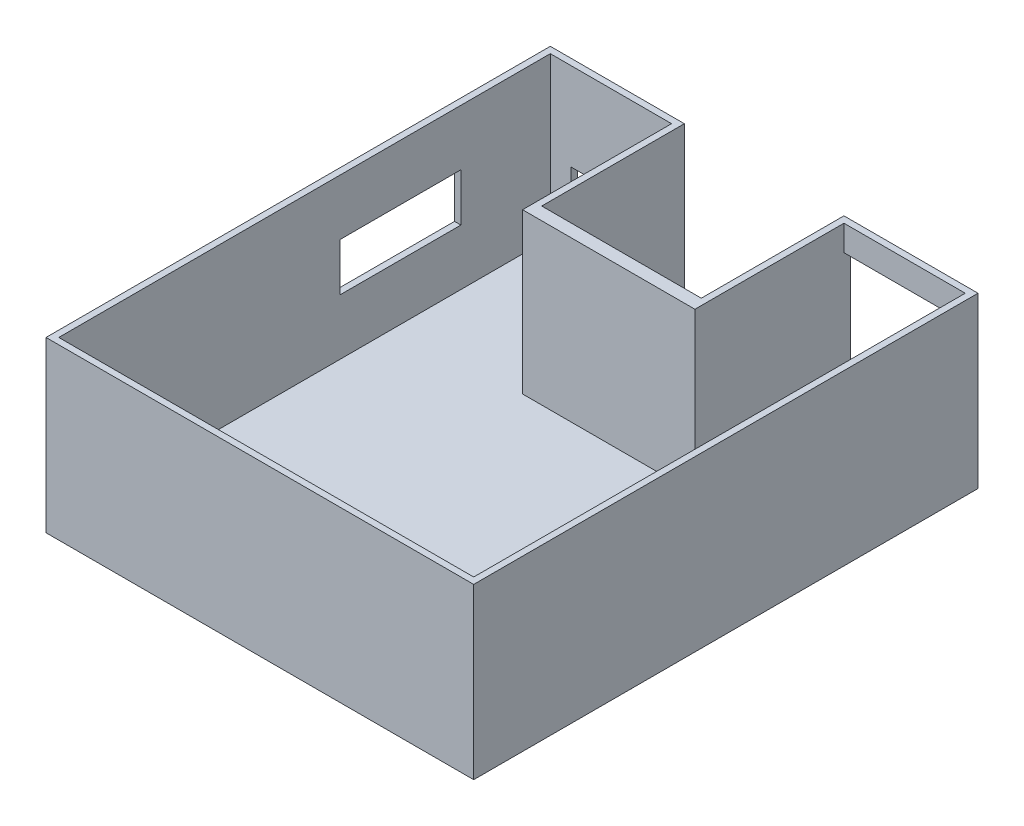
ISO-10303-21;
HEADER;
FILE_DESCRIPTION(('STEP AP214'),'2;1');
FILE_NAME('part.step','',(''),(''),'','','');
FILE_SCHEMA(('AUTOMOTIVE_DESIGN { 1 0 10303 214 1 1 1 1 }'));
ENDSEC;
DATA;
#1=APPLICATION_CONTEXT('core data for automotive mechanical design processes');
#2=APPLICATION_PROTOCOL_DEFINITION('international standard','automotive_design',2000,#1);
#3=PRODUCT_CONTEXT('',#1,'mechanical');
#4=PRODUCT('Part','Part','',(#3));
#5=PRODUCT_RELATED_PRODUCT_CATEGORY('part','',(#4));
#6=PRODUCT_DEFINITION_FORMATION('','',#4);
#7=PRODUCT_DEFINITION_CONTEXT('part definition',#1,'design');
#8=PRODUCT_DEFINITION('design','',#6,#7);
#9=PRODUCT_DEFINITION_SHAPE('','',#8);
#10=(LENGTH_UNIT() NAMED_UNIT(*) SI_UNIT(.MILLI.,.METRE.));
#11=(NAMED_UNIT(*) PLANE_ANGLE_UNIT() SI_UNIT($,.RADIAN.));
#12=(NAMED_UNIT(*) SI_UNIT($,.STERADIAN.) SOLID_ANGLE_UNIT());
#13=UNCERTAINTY_MEASURE_WITH_UNIT(LENGTH_MEASURE(1.E-05),#10,'distance_accuracy_value','');
#14=(GEOMETRIC_REPRESENTATION_CONTEXT(3) GLOBAL_UNCERTAINTY_ASSIGNED_CONTEXT((#13)) GLOBAL_UNIT_ASSIGNED_CONTEXT((#10,
#11,#12)) REPRESENTATION_CONTEXT('',''));
#15=CARTESIAN_POINT('',(0.,0.,0.));
#16=DIRECTION('',(0.,0.,1.));
#17=DIRECTION('',(1.,0.,0.));
#18=AXIS2_PLACEMENT_3D('',#15,#16,#17);
#19=CARTESIAN_POINT('',(-27.,0.,-99.));
#20=DIRECTION('',(0.,0.,1.));
#21=DIRECTION('',(1.,0.,0.));
#22=AXIS2_PLACEMENT_3D('',#19,#20,#21);
#23=PLANE('',#22);
#24=DIRECTION('',(0.,1.,0.));
#25=VECTOR('',#24,1.);
#26=CARTESIAN_POINT('',(-33.5000000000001,0.,-99.));
#27=LINE('',#26,#25);
#28=CARTESIAN_POINT('',(-33.5000000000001,15.5,-99.));
#29=VERTEX_POINT('',#28);
#30=CARTESIAN_POINT('',(-33.5000000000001,25.5,-99.));
#31=VERTEX_POINT('',#30);
#32=EDGE_CURVE('E302',#29,#31,#27,.T.);
#33=ORIENTED_EDGE('',*,*,#32,.F.);
#34=DIRECTION('',(1.,0.,0.));
#35=VECTOR('',#34,1.);
#36=CARTESIAN_POINT('',(-27.,15.5,-99.));
#37=LINE('',#36,#35);
#38=CARTESIAN_POINT('',(-58.5000000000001,15.5,-99.));
#39=VERTEX_POINT('',#38);
#40=EDGE_CURVE('E295',#39,#29,#37,.T.);
#41=ORIENTED_EDGE('',*,*,#40,.F.);
#42=DIRECTION('',(0.,-1.,0.));
#43=VECTOR('',#42,1.);
#44=CARTESIAN_POINT('',(-58.5000000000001,0.,-99.));
#45=LINE('',#44,#43);
#46=CARTESIAN_POINT('',(-58.5000000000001,25.5,-99.));
#47=VERTEX_POINT('',#46);
#48=EDGE_CURVE('E297',#47,#39,#45,.T.);
#49=ORIENTED_EDGE('',*,*,#48,.F.);
#50=DIRECTION('',(-1.,0.,0.));
#51=VECTOR('',#50,1.);
#52=CARTESIAN_POINT('',(-27.,25.5,-99.));
#53=LINE('',#52,#51);
#54=EDGE_CURVE('E300',#31,#47,#53,.T.);
#55=ORIENTED_EDGE('',*,*,#54,.F.);
#56=EDGE_LOOP('',(#33,#41,#49,#55));
#57=FACE_BOUND('',#56,.T.);
#58=DIRECTION('',(1.,0.,0.));
#59=VECTOR('',#58,1.);
#60=CARTESIAN_POINT('',(-27.,53.,-99.));
#61=LINE('',#60,#59);
#62=CARTESIAN_POINT('',(-65.,53.,-99.));
#63=VERTEX_POINT('',#62);
#64=CARTESIAN_POINT('',(-27.,53.,-99.));
#65=VERTEX_POINT('',#64);
#66=EDGE_CURVE('E372',#63,#65,#61,.T.);
#67=ORIENTED_EDGE('',*,*,#66,.F.);
#68=DIRECTION('',(0.,-1.,0.));
#69=VECTOR('',#68,1.);
#70=CARTESIAN_POINT('',(-65.,0.,-99.));
#71=LINE('',#70,#69);
#72=CARTESIAN_POINT('',(-65.,3.,-99.));
#73=VERTEX_POINT('',#72);
#74=EDGE_CURVE('E359',#63,#73,#71,.T.);
#75=ORIENTED_EDGE('',*,*,#74,.T.);
#76=DIRECTION('',(1.,0.,0.));
#77=VECTOR('',#76,1.);
#78=CARTESIAN_POINT('',(0.,3.,-99.));
#79=LINE('',#78,#77);
#80=CARTESIAN_POINT('',(-27.,3.,-99.));
#81=VERTEX_POINT('',#80);
#82=EDGE_CURVE('E389',#73,#81,#79,.T.);
#83=ORIENTED_EDGE('',*,*,#82,.T.);
#84=DIRECTION('',(0.,1.,0.));
#85=VECTOR('',#84,1.);
#86=CARTESIAN_POINT('',(-27.,0.,-99.));
#87=LINE('',#86,#85);
#88=EDGE_CURVE('E385',#81,#65,#87,.T.);
#89=ORIENTED_EDGE('',*,*,#88,.T.);
#90=EDGE_LOOP('',(#67,#75,#83,#89));
#91=FACE_BOUND('',#90,.T.);
#92=ADVANCED_FACE('F41',(#57,#91),#23,.T.);
#93=CARTESIAN_POINT('',(65.,3.,-101.));
#94=DIRECTION('',(0.,0.,1.));
#95=DIRECTION('',(1.,0.,0.));
#96=AXIS2_PLACEMENT_3D('',#93,#94,#95);
#97=PLANE('',#96);
#98=DIRECTION('',(-1.,0.,0.));
#99=VECTOR('',#98,1.);
#100=CARTESIAN_POINT('',(63.9999999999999,3.,-101.));
#101=LINE('',#100,#99);
#102=CARTESIAN_POINT('',(63.9999999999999,3.,-101.));
#103=VERTEX_POINT('',#102);
#104=CARTESIAN_POINT('',(26.9999999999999,3.,-101.));
#105=VERTEX_POINT('',#104);
#106=EDGE_CURVE('E258',#103,#105,#101,.T.);
#107=ORIENTED_EDGE('',*,*,#106,.F.);
#108=DIRECTION('',(0.,-1.,0.));
#109=VECTOR('',#108,1.);
#110=CARTESIAN_POINT('',(63.9999999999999,45.,-101.));
#111=LINE('',#110,#109);
#112=CARTESIAN_POINT('',(63.9999999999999,45.,-101.));
#113=VERTEX_POINT('',#112);
#114=EDGE_CURVE('E256',#113,#103,#111,.T.);
#115=ORIENTED_EDGE('',*,*,#114,.F.);
#116=DIRECTION('',(1.,0.,0.));
#117=VECTOR('',#116,1.);
#118=CARTESIAN_POINT('',(63.9999999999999,45.,-101.));
#119=LINE('',#118,#117);
#120=CARTESIAN_POINT('',(26.9999999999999,45.,-101.));
#121=VERTEX_POINT('',#120);
#122=EDGE_CURVE('E265',#121,#113,#119,.T.);
#123=ORIENTED_EDGE('',*,*,#122,.F.);
#124=DIRECTION('',(0.,1.,0.));
#125=VECTOR('',#124,1.);
#126=CARTESIAN_POINT('',(26.9999999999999,45.,-101.));
#127=LINE('',#126,#125);
#128=EDGE_CURVE('E262',#105,#121,#127,.T.);
#129=ORIENTED_EDGE('',*,*,#128,.F.);
#130=EDGE_LOOP('',(#107,#115,#123,#129));
#131=FACE_BOUND('',#130,.T.);
#132=DIRECTION('',(-1.,0.,0.));
#133=VECTOR('',#132,1.);
#134=CARTESIAN_POINT('',(65.,0.,-101.));
#135=LINE('',#134,#133);
#136=CARTESIAN_POINT('',(67.,0.,-101.));
#137=VERTEX_POINT('',#136);
#138=CARTESIAN_POINT('',(25.,0.,-101.));
#139=VERTEX_POINT('',#138);
#140=EDGE_CURVE('E399',#137,#139,#135,.T.);
#141=ORIENTED_EDGE('',*,*,#140,.T.);
#142=DIRECTION('',(0.,-1.,0.));
#143=VECTOR('',#142,1.);
#144=CARTESIAN_POINT('',(25.,3.,-101.));
#145=LINE('',#144,#143);
#146=CARTESIAN_POINT('',(25.,53.,-101.));
#147=VERTEX_POINT('',#146);
#148=EDGE_CURVE('E421',#147,#139,#145,.T.);
#149=ORIENTED_EDGE('',*,*,#148,.F.);
#150=DIRECTION('',(-1.,0.,0.));
#151=VECTOR('',#150,1.);
#152=CARTESIAN_POINT('',(0.,53.,-101.));
#153=LINE('',#152,#151);
#154=CARTESIAN_POINT('',(67.,53.,-101.));
#155=VERTEX_POINT('',#154);
#156=EDGE_CURVE('E336',#155,#147,#153,.T.);
#157=ORIENTED_EDGE('',*,*,#156,.F.);
#158=DIRECTION('',(0.,1.,0.));
#159=VECTOR('',#158,1.);
#160=CARTESIAN_POINT('',(67.,0.,-101.));
#161=LINE('',#160,#159);
#162=EDGE_CURVE('E356',#137,#155,#161,.T.);
#163=ORIENTED_EDGE('',*,*,#162,.F.);
#164=EDGE_LOOP('',(#141,#149,#157,#163));
#165=FACE_BOUND('',#164,.T.);
#166=ADVANCED_FACE('F43',(#131,#165),#97,.F.);
#167=CARTESIAN_POINT('',(25.,3.,-52.311907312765));
#168=DIRECTION('',(1.,0.,0.));
#169=DIRECTION('',(0.,0.,-1.));
#170=AXIS2_PLACEMENT_3D('',#167,#168,#169);
#171=PLANE('',#170);
#172=DIRECTION('',(0.,0.,1.));
#173=VECTOR('',#172,1.);
#174=CARTESIAN_POINT('',(25.,0.,-52.311907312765));
#175=LINE('',#174,#173);
#176=CARTESIAN_POINT('',(25.,0.,-56.311907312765));
#177=VERTEX_POINT('',#176);
#178=EDGE_CURVE('E414',#139,#177,#175,.T.);
#179=ORIENTED_EDGE('',*,*,#178,.T.);
#180=DIRECTION('',(0.,1.,0.));
#181=VECTOR('',#180,1.);
#182=CARTESIAN_POINT('',(25.,0.,-56.311907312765));
#183=LINE('',#182,#181);
#184=CARTESIAN_POINT('',(25.,53.,-56.311907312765));
#185=VERTEX_POINT('',#184);
#186=EDGE_CURVE('E310',#177,#185,#183,.T.);
#187=ORIENTED_EDGE('',*,*,#186,.T.);
#188=DIRECTION('',(0.,0.,1.));
#189=VECTOR('',#188,1.);
#190=CARTESIAN_POINT('',(25.,53.,-52.311907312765));
#191=LINE('',#190,#189);
#192=EDGE_CURVE('E319',#147,#185,#191,.T.);
#193=ORIENTED_EDGE('',*,*,#192,.F.);
#194=ORIENTED_EDGE('',*,*,#148,.T.);
#195=EDGE_LOOP('',(#179,#187,#193,#194));
#196=FACE_BOUND('',#195,.T.);
#197=ADVANCED_FACE('F465',(#196),#171,.F.);
#198=CARTESIAN_POINT('',(-25.,3.,-52.311907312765));
#199=DIRECTION('',(-1.,0.,0.));
#200=DIRECTION('',(0.,0.,1.));
#201=AXIS2_PLACEMENT_3D('',#198,#199,#200);
#202=PLANE('',#201);
#203=DIRECTION('',(0.,0.,-1.));
#204=VECTOR('',#203,1.);
#205=CARTESIAN_POINT('',(-25.,53.,-101.));
#206=LINE('',#205,#204);
#207=CARTESIAN_POINT('',(-25.,53.,-56.311907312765));
#208=VERTEX_POINT('',#207);
#209=CARTESIAN_POINT('',(-25.,53.,-101.));
#210=VERTEX_POINT('',#209);
#211=EDGE_CURVE('E379',#208,#210,#206,.T.);
#212=ORIENTED_EDGE('',*,*,#211,.F.);
#213=DIRECTION('',(0.,1.,0.));
#214=VECTOR('',#213,1.);
#215=CARTESIAN_POINT('',(-25.,0.,-56.311907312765));
#216=LINE('',#215,#214);
#217=CARTESIAN_POINT('',(-25.,0.,-56.311907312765));
#218=VERTEX_POINT('',#217);
#219=EDGE_CURVE('E311',#218,#208,#216,.T.);
#220=ORIENTED_EDGE('',*,*,#219,.F.);
#221=DIRECTION('',(0.,0.,-1.));
#222=VECTOR('',#221,1.);
#223=CARTESIAN_POINT('',(-25.,0.,-52.311907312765));
#224=LINE('',#223,#222);
#225=CARTESIAN_POINT('',(-25.,0.,-101.));
#226=VERTEX_POINT('',#225);
#227=EDGE_CURVE('E416',#218,#226,#224,.T.);
#228=ORIENTED_EDGE('',*,*,#227,.T.);
#229=DIRECTION('',(0.,-1.,0.));
#230=VECTOR('',#229,1.);
#231=CARTESIAN_POINT('',(-25.,3.,-101.));
#232=LINE('',#231,#230);
#233=EDGE_CURVE('E412',#210,#226,#232,.T.);
#234=ORIENTED_EDGE('',*,*,#233,.F.);
#235=EDGE_LOOP('',(#212,#220,#228,#234));
#236=FACE_BOUND('',#235,.T.);
#237=ADVANCED_FACE('F500',(#236),#202,.F.);
#238=CARTESIAN_POINT('',(-65.,3.,-101.));
#239=DIRECTION('',(0.,0.,1.));
#240=DIRECTION('',(1.,0.,0.));
#241=AXIS2_PLACEMENT_3D('',#238,#239,#240);
#242=PLANE('',#241);
#243=DIRECTION('',(-1.,0.,0.));
#244=VECTOR('',#243,1.);
#245=CARTESIAN_POINT('',(-33.5000000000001,15.5,-101.));
#246=LINE('',#245,#244);
#247=CARTESIAN_POINT('',(-33.5000000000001,15.5,-101.));
#248=VERTEX_POINT('',#247);
#249=CARTESIAN_POINT('',(-58.5000000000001,15.5,-101.));
#250=VERTEX_POINT('',#249);
#251=EDGE_CURVE('E290',#248,#250,#246,.T.);
#252=ORIENTED_EDGE('',*,*,#251,.F.);
#253=DIRECTION('',(0.,-1.,0.));
#254=VECTOR('',#253,1.);
#255=CARTESIAN_POINT('',(-33.5000000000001,25.5,-101.));
#256=LINE('',#255,#254);
#257=CARTESIAN_POINT('',(-33.5000000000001,25.5,-101.));
#258=VERTEX_POINT('',#257);
#259=EDGE_CURVE('E259',#258,#248,#256,.T.);
#260=ORIENTED_EDGE('',*,*,#259,.F.);
#261=DIRECTION('',(1.,0.,0.));
#262=VECTOR('',#261,1.);
#263=CARTESIAN_POINT('',(-33.5000000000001,25.5,-101.));
#264=LINE('',#263,#262);
#265=CARTESIAN_POINT('',(-58.5000000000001,25.5,-101.));
#266=VERTEX_POINT('',#265);
#267=EDGE_CURVE('E279',#266,#258,#264,.T.);
#268=ORIENTED_EDGE('',*,*,#267,.F.);
#269=DIRECTION('',(0.,1.,0.));
#270=VECTOR('',#269,1.);
#271=CARTESIAN_POINT('',(-58.5000000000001,25.5,-101.));
#272=LINE('',#271,#270);
#273=EDGE_CURVE('E287',#250,#266,#272,.T.);
#274=ORIENTED_EDGE('',*,*,#273,.F.);
#275=EDGE_LOOP('',(#252,#260,#268,#274));
#276=FACE_BOUND('',#275,.T.);
#277=DIRECTION('',(0.,1.,0.));
#278=VECTOR('',#277,1.);
#279=CARTESIAN_POINT('',(-67.,0.,-101.));
#280=LINE('',#279,#278);
#281=CARTESIAN_POINT('',(-67.,0.,-101.));
#282=VERTEX_POINT('',#281);
#283=CARTESIAN_POINT('',(-67.,53.,-101.));
#284=VERTEX_POINT('',#283);
#285=EDGE_CURVE('E386',#282,#284,#280,.T.);
#286=ORIENTED_EDGE('',*,*,#285,.T.);
#287=DIRECTION('',(-1.,0.,0.));
#288=VECTOR('',#287,1.);
#289=CARTESIAN_POINT('',(-67.,53.,-101.));
#290=LINE('',#289,#288);
#291=EDGE_CURVE('E381',#210,#284,#290,.T.);
#292=ORIENTED_EDGE('',*,*,#291,.F.);
#293=ORIENTED_EDGE('',*,*,#233,.T.);
#294=DIRECTION('',(-1.,0.,0.));
#295=VECTOR('',#294,1.);
#296=CARTESIAN_POINT('',(-65.,0.,-101.));
#297=LINE('',#296,#295);
#298=EDGE_CURVE('E404',#226,#282,#297,.T.);
#299=ORIENTED_EDGE('',*,*,#298,.T.);
#300=EDGE_LOOP('',(#286,#292,#293,#299));
#301=FACE_BOUND('',#300,.T.);
#302=ADVANCED_FACE('F496',(#276,#301),#242,.F.);
#303=CARTESIAN_POINT('',(0.,3.,0.));
#304=DIRECTION('',(0.,1.,0.));
#305=DIRECTION('',(0.,0.,1.));
#306=AXIS2_PLACEMENT_3D('',#303,#304,#305);
#307=PLANE('',#306);
#308=DIRECTION('',(1.,0.,0.));
#309=VECTOR('',#308,1.);
#310=CARTESIAN_POINT('',(0.,3.,-99.));
#311=LINE('',#310,#309);
#312=CARTESIAN_POINT('',(63.9999999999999,3.,-99.));
#313=VERTEX_POINT('',#312);
#314=CARTESIAN_POINT('',(65.,3.,-99.));
#315=VERTEX_POINT('',#314);
#316=EDGE_CURVE('E329',#313,#315,#311,.T.);
#317=ORIENTED_EDGE('',*,*,#316,.F.);
#318=DIRECTION('',(0.,0.,-1.));
#319=VECTOR('',#318,1.);
#320=CARTESIAN_POINT('',(63.9999999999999,3.,-63.));
#321=LINE('',#320,#319);
#322=EDGE_CURVE('E268',#313,#103,#321,.T.);
#323=ORIENTED_EDGE('',*,*,#322,.T.);
#324=ORIENTED_EDGE('',*,*,#106,.T.);
#325=DIRECTION('',(0.,0.,-1.));
#326=VECTOR('',#325,1.);
#327=CARTESIAN_POINT('',(27.,3.,0.));
#328=LINE('',#327,#326);
#329=CARTESIAN_POINT('',(27.,3.,-52.311907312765));
#330=VERTEX_POINT('',#329);
#331=EDGE_CURVE('E331',#330,#105,#328,.T.);
#332=ORIENTED_EDGE('',*,*,#331,.F.);
#333=DIRECTION('',(-1.,0.,0.));
#334=VECTOR('',#333,1.);
#335=CARTESIAN_POINT('',(-25.,3.,-52.311907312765));
#336=LINE('',#335,#334);
#337=CARTESIAN_POINT('',(-27.,3.,-52.311907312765));
#338=VERTEX_POINT('',#337);
#339=EDGE_CURVE('E403',#330,#338,#336,.T.);
#340=ORIENTED_EDGE('',*,*,#339,.T.);
#341=DIRECTION('',(0.,0.,1.));
#342=VECTOR('',#341,1.);
#343=CARTESIAN_POINT('',(-27.,3.,0.));
#344=LINE('',#343,#342);
#345=EDGE_CURVE('E396',#81,#338,#344,.T.);
#346=ORIENTED_EDGE('',*,*,#345,.F.);
#347=ORIENTED_EDGE('',*,*,#82,.F.);
#348=DIRECTION('',(0.,0.,1.));
#349=VECTOR('',#348,1.);
#350=CARTESIAN_POINT('',(-65.,3.,-55.));
#351=LINE('',#350,#349);
#352=CARTESIAN_POINT('',(-65.,3.,55.));
#353=VERTEX_POINT('',#352);
#354=EDGE_CURVE('E406',#73,#353,#351,.T.);
#355=ORIENTED_EDGE('',*,*,#354,.T.);
#356=DIRECTION('',(1.,0.,0.));
#357=VECTOR('',#356,1.);
#358=CARTESIAN_POINT('',(-65.,3.,55.));
#359=LINE('',#358,#357);
#360=CARTESIAN_POINT('',(65.,3.,55.));
#361=VERTEX_POINT('',#360);
#362=EDGE_CURVE('E409',#353,#361,#359,.T.);
#363=ORIENTED_EDGE('',*,*,#362,.T.);
#364=DIRECTION('',(0.,0.,-1.));
#365=VECTOR('',#364,1.);
#366=CARTESIAN_POINT('',(65.,3.,-55.));
#367=LINE('',#366,#365);
#368=EDGE_CURVE('E400',#361,#315,#367,.T.);
#369=ORIENTED_EDGE('',*,*,#368,.T.);
#370=EDGE_LOOP('',(#317,#323,#324,#332,#340,#346,#347,#355,#363,#369));
#371=FACE_BOUND('',#370,.T.);
#372=ADVANCED_FACE('F433',(#371),#307,.T.);
#373=CARTESIAN_POINT('',(0.,0.,0.));
#374=DIRECTION('',(0.,1.,0.));
#375=DIRECTION('',(0.,0.,1.));
#376=AXIS2_PLACEMENT_3D('',#373,#374,#375);
#377=PLANE('',#376);
#378=ORIENTED_EDGE('',*,*,#227,.F.);
#379=DIRECTION('',(-1.,0.,0.));
#380=VECTOR('',#379,1.);
#381=CARTESIAN_POINT('',(-25.,0.,-56.311907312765));
#382=LINE('',#381,#380);
#383=EDGE_CURVE('E307',#177,#218,#382,.T.);
#384=ORIENTED_EDGE('',*,*,#383,.F.);
#385=ORIENTED_EDGE('',*,*,#178,.F.);
#386=ORIENTED_EDGE('',*,*,#140,.F.);
#387=DIRECTION('',(0.,0.,-1.));
#388=VECTOR('',#387,1.);
#389=CARTESIAN_POINT('',(67.,0.,0.));
#390=LINE('',#389,#388);
#391=CARTESIAN_POINT('',(67.,0.,57.));
#392=VERTEX_POINT('',#391);
#393=EDGE_CURVE('E350',#392,#137,#390,.T.);
#394=ORIENTED_EDGE('',*,*,#393,.F.);
#395=DIRECTION('',(1.,0.,0.));
#396=VECTOR('',#395,1.);
#397=CARTESIAN_POINT('',(0.,0.,57.));
#398=LINE('',#397,#396);
#399=CARTESIAN_POINT('',(-67.,0.,57.));
#400=VERTEX_POINT('',#399);
#401=EDGE_CURVE('E353',#400,#392,#398,.T.);
#402=ORIENTED_EDGE('',*,*,#401,.F.);
#403=DIRECTION('',(0.,0.,1.));
#404=VECTOR('',#403,1.);
#405=CARTESIAN_POINT('',(-67.,0.,-99.));
#406=LINE('',#405,#404);
#407=EDGE_CURVE('E383',#282,#400,#406,.T.);
#408=ORIENTED_EDGE('',*,*,#407,.F.);
#409=ORIENTED_EDGE('',*,*,#298,.F.);
#410=EDGE_LOOP('',(#378,#384,#385,#386,#394,#402,#408,#409));
#411=FACE_BOUND('',#410,.T.);
#412=ADVANCED_FACE('F476',(#411),#377,.F.);
#413=CARTESIAN_POINT('',(-67.,0.,-99.));
#414=DIRECTION('',(-1.,0.,0.));
#415=DIRECTION('',(0.,0.,1.));
#416=AXIS2_PLACEMENT_3D('',#413,#414,#415);
#417=PLANE('',#416);
#418=DIRECTION('',(0.,-1.,0.));
#419=VECTOR('',#418,1.);
#420=CARTESIAN_POINT('',(-67.,35.5,-71.));
#421=LINE('',#420,#419);
#422=CARTESIAN_POINT('',(-67.,35.5,-71.));
#423=VERTEX_POINT('',#422);
#424=CARTESIAN_POINT('',(-67.,20.5,-71.));
#425=VERTEX_POINT('',#424);
#426=EDGE_CURVE('E56',#423,#425,#421,.T.);
#427=ORIENTED_EDGE('',*,*,#426,.F.);
#428=DIRECTION('',(0.,0.,1.));
#429=VECTOR('',#428,1.);
#430=CARTESIAN_POINT('',(-67.,35.5,-71.));
#431=LINE('',#430,#429);
#432=CARTESIAN_POINT('',(-67.,35.5,-33.104592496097));
#433=VERTEX_POINT('',#432);
#434=EDGE_CURVE('E227',#423,#433,#431,.T.);
#435=ORIENTED_EDGE('',*,*,#434,.T.);
#436=DIRECTION('',(0.,-1.,0.));
#437=VECTOR('',#436,1.);
#438=CARTESIAN_POINT('',(-67.,35.5,-33.104592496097));
#439=LINE('',#438,#437);
#440=CARTESIAN_POINT('',(-67.,20.5,-33.104592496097));
#441=VERTEX_POINT('',#440);
#442=EDGE_CURVE('E247',#433,#441,#439,.T.);
#443=ORIENTED_EDGE('',*,*,#442,.T.);
#444=DIRECTION('',(0.,0.,1.));
#445=VECTOR('',#444,1.);
#446=CARTESIAN_POINT('',(-67.,20.5,-71.));
#447=LINE('',#446,#445);
#448=EDGE_CURVE('E241',#425,#441,#447,.T.);
#449=ORIENTED_EDGE('',*,*,#448,.F.);
#450=EDGE_LOOP('',(#427,#435,#443,#449));
#451=FACE_BOUND('',#450,.T.);
#452=ORIENTED_EDGE('',*,*,#407,.T.);
#453=DIRECTION('',(0.,1.,0.));
#454=VECTOR('',#453,1.);
#455=CARTESIAN_POINT('',(-67.,0.,57.));
#456=LINE('',#455,#454);
#457=CARTESIAN_POINT('',(-67.,53.,57.));
#458=VERTEX_POINT('',#457);
#459=EDGE_CURVE('E360',#400,#458,#456,.T.);
#460=ORIENTED_EDGE('',*,*,#459,.T.);
#461=DIRECTION('',(0.,0.,1.));
#462=VECTOR('',#461,1.);
#463=CARTESIAN_POINT('',(-67.,53.,-99.));
#464=LINE('',#463,#462);
#465=EDGE_CURVE('E370',#284,#458,#464,.T.);
#466=ORIENTED_EDGE('',*,*,#465,.F.);
#467=ORIENTED_EDGE('',*,*,#285,.F.);
#468=EDGE_LOOP('',(#452,#460,#466,#467));
#469=FACE_BOUND('',#468,.T.);
#470=ADVANCED_FACE('F493',(#451,#469),#417,.T.);
#471=CARTESIAN_POINT('',(-27.,0.,-52.311907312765));
#472=DIRECTION('',(0.,0.,1.));
#473=DIRECTION('',(1.,0.,0.));
#474=AXIS2_PLACEMENT_3D('',#471,#472,#473);
#475=PLANE('',#474);
#476=DIRECTION('',(0.,1.,0.));
#477=VECTOR('',#476,1.);
#478=CARTESIAN_POINT('',(-27.,0.,-52.311907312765));
#479=LINE('',#478,#477);
#480=CARTESIAN_POINT('',(-27.,53.,-52.311907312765));
#481=VERTEX_POINT('',#480);
#482=EDGE_CURVE('E390',#338,#481,#479,.T.);
#483=ORIENTED_EDGE('',*,*,#482,.F.);
#484=ORIENTED_EDGE('',*,*,#339,.F.);
#485=DIRECTION('',(0.,1.,0.));
#486=VECTOR('',#485,1.);
#487=CARTESIAN_POINT('',(27.,0.,-52.311907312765));
#488=LINE('',#487,#486);
#489=CARTESIAN_POINT('',(27.,53.,-52.311907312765));
#490=VERTEX_POINT('',#489);
#491=EDGE_CURVE('E316',#330,#490,#488,.T.);
#492=ORIENTED_EDGE('',*,*,#491,.T.);
#493=DIRECTION('',(1.,0.,0.));
#494=VECTOR('',#493,1.);
#495=CARTESIAN_POINT('',(-27.,53.,-52.311907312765));
#496=LINE('',#495,#494);
#497=EDGE_CURVE('E377',#481,#490,#496,.T.);
#498=ORIENTED_EDGE('',*,*,#497,.F.);
#499=EDGE_LOOP('',(#483,#484,#492,#498));
#500=FACE_BOUND('',#499,.T.);
#501=ADVANCED_FACE('F524',(#500),#475,.T.);
#502=CARTESIAN_POINT('',(-27.,0.,-52.311907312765));
#503=DIRECTION('',(-1.,0.,0.));
#504=DIRECTION('',(0.,0.,1.));
#505=AXIS2_PLACEMENT_3D('',#502,#503,#504);
#506=PLANE('',#505);
#507=ORIENTED_EDGE('',*,*,#88,.F.);
#508=ORIENTED_EDGE('',*,*,#345,.T.);
#509=ORIENTED_EDGE('',*,*,#482,.T.);
#510=DIRECTION('',(0.,0.,1.));
#511=VECTOR('',#510,1.);
#512=CARTESIAN_POINT('',(-27.,53.,-52.311907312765));
#513=LINE('',#512,#511);
#514=EDGE_CURVE('E374',#65,#481,#513,.T.);
#515=ORIENTED_EDGE('',*,*,#514,.F.);
#516=EDGE_LOOP('',(#507,#508,#509,#515));
#517=FACE_BOUND('',#516,.T.);
#518=ADVANCED_FACE('F520',(#517),#506,.T.);
#519=CARTESIAN_POINT('',(0.,53.,0.));
#520=DIRECTION('',(0.,-1.,0.));
#521=DIRECTION('',(0.,0.,-1.));
#522=AXIS2_PLACEMENT_3D('',#519,#520,#521);
#523=PLANE('',#522);
#524=DIRECTION('',(-1.,0.,0.));
#525=VECTOR('',#524,1.);
#526=CARTESIAN_POINT('',(-25.,53.,-56.311907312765));
#527=LINE('',#526,#525);
#528=EDGE_CURVE('E304',#185,#208,#527,.T.);
#529=ORIENTED_EDGE('',*,*,#528,.T.);
#530=ORIENTED_EDGE('',*,*,#211,.T.);
#531=ORIENTED_EDGE('',*,*,#291,.T.);
#532=ORIENTED_EDGE('',*,*,#465,.T.);
#533=DIRECTION('',(1.,0.,0.));
#534=VECTOR('',#533,1.);
#535=CARTESIAN_POINT('',(0.,53.,57.));
#536=LINE('',#535,#534);
#537=CARTESIAN_POINT('',(67.,53.,57.));
#538=VERTEX_POINT('',#537);
#539=EDGE_CURVE('E347',#458,#538,#536,.T.);
#540=ORIENTED_EDGE('',*,*,#539,.T.);
#541=DIRECTION('',(0.,0.,-1.));
#542=VECTOR('',#541,1.);
#543=CARTESIAN_POINT('',(67.,53.,0.));
#544=LINE('',#543,#542);
#545=EDGE_CURVE('E333',#538,#155,#544,.T.);
#546=ORIENTED_EDGE('',*,*,#545,.T.);
#547=ORIENTED_EDGE('',*,*,#156,.T.);
#548=ORIENTED_EDGE('',*,*,#192,.T.);
#549=EDGE_LOOP('',(#529,#530,#531,#532,#540,#546,#547,#548));
#550=FACE_BOUND('',#549,.T.);
#551=ORIENTED_EDGE('',*,*,#497,.T.);
#552=DIRECTION('',(0.,0.,-1.));
#553=VECTOR('',#552,1.);
#554=CARTESIAN_POINT('',(27.,53.,-99.));
#555=LINE('',#554,#553);
#556=CARTESIAN_POINT('',(27.,53.,-99.));
#557=VERTEX_POINT('',#556);
#558=EDGE_CURVE('E326',#490,#557,#555,.T.);
#559=ORIENTED_EDGE('',*,*,#558,.T.);
#560=DIRECTION('',(1.,0.,0.));
#561=VECTOR('',#560,1.);
#562=CARTESIAN_POINT('',(65.,53.,-99.));
#563=LINE('',#562,#561);
#564=CARTESIAN_POINT('',(65.,53.,-99.));
#565=VERTEX_POINT('',#564);
#566=EDGE_CURVE('E323',#557,#565,#563,.T.);
#567=ORIENTED_EDGE('',*,*,#566,.T.);
#568=DIRECTION('',(0.,0.,-1.));
#569=VECTOR('',#568,1.);
#570=CARTESIAN_POINT('',(65.,53.,0.));
#571=LINE('',#570,#569);
#572=CARTESIAN_POINT('',(65.,53.,55.));
#573=VERTEX_POINT('',#572);
#574=EDGE_CURVE('E339',#573,#565,#571,.T.);
#575=ORIENTED_EDGE('',*,*,#574,.F.);
#576=DIRECTION('',(1.,0.,0.));
#577=VECTOR('',#576,1.);
#578=CARTESIAN_POINT('',(0.,53.,55.));
#579=LINE('',#578,#577);
#580=CARTESIAN_POINT('',(-65.,53.,55.));
#581=VERTEX_POINT('',#580);
#582=EDGE_CURVE('E341',#581,#573,#579,.T.);
#583=ORIENTED_EDGE('',*,*,#582,.F.);
#584=DIRECTION('',(0.,0.,1.));
#585=VECTOR('',#584,1.);
#586=CARTESIAN_POINT('',(-65.,53.,0.));
#587=LINE('',#586,#585);
#588=EDGE_CURVE('E344',#63,#581,#587,.T.);
#589=ORIENTED_EDGE('',*,*,#588,.F.);
#590=ORIENTED_EDGE('',*,*,#66,.T.);
#591=ORIENTED_EDGE('',*,*,#514,.T.);
#592=EDGE_LOOP('',(#551,#559,#567,#575,#583,#589,#590,#591));
#593=FACE_BOUND('',#592,.T.);
#594=ADVANCED_FACE('F442',(#550,#593),#523,.F.);
#595=CARTESIAN_POINT('',(67.,0.,0.));
#596=DIRECTION('',(1.,0.,0.));
#597=DIRECTION('',(0.,0.,-1.));
#598=AXIS2_PLACEMENT_3D('',#595,#596,#597);
#599=PLANE('',#598);
#600=ORIENTED_EDGE('',*,*,#162,.T.);
#601=ORIENTED_EDGE('',*,*,#545,.F.);
#602=DIRECTION('',(0.,1.,0.));
#603=VECTOR('',#602,1.);
#604=CARTESIAN_POINT('',(67.,0.,57.));
#605=LINE('',#604,#603);
#606=EDGE_CURVE('E357',#392,#538,#605,.T.);
#607=ORIENTED_EDGE('',*,*,#606,.F.);
#608=ORIENTED_EDGE('',*,*,#393,.T.);
#609=EDGE_LOOP('',(#600,#601,#607,#608));
#610=FACE_BOUND('',#609,.T.);
#611=ADVANCED_FACE('F485',(#610),#599,.T.);
#612=CARTESIAN_POINT('',(0.,0.,57.));
#613=DIRECTION('',(0.,0.,1.));
#614=DIRECTION('',(1.,0.,0.));
#615=AXIS2_PLACEMENT_3D('',#612,#613,#614);
#616=PLANE('',#615);
#617=ORIENTED_EDGE('',*,*,#606,.T.);
#618=ORIENTED_EDGE('',*,*,#539,.F.);
#619=ORIENTED_EDGE('',*,*,#459,.F.);
#620=ORIENTED_EDGE('',*,*,#401,.T.);
#621=EDGE_LOOP('',(#617,#618,#619,#620));
#622=FACE_BOUND('',#621,.T.);
#623=ADVANCED_FACE('F490',(#622),#616,.T.);
#624=CARTESIAN_POINT('',(-65.,0.,0.));
#625=DIRECTION('',(-1.,0.,0.));
#626=DIRECTION('',(0.,0.,1.));
#627=AXIS2_PLACEMENT_3D('',#624,#625,#626);
#628=PLANE('',#627);
#629=DIRECTION('',(0.,0.,-1.));
#630=VECTOR('',#629,1.);
#631=CARTESIAN_POINT('',(-65.,35.5,-71.));
#632=LINE('',#631,#630);
#633=CARTESIAN_POINT('',(-65.,35.5,-33.104592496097));
#634=VERTEX_POINT('',#633);
#635=CARTESIAN_POINT('',(-65.,35.5,-71.));
#636=VERTEX_POINT('',#635);
#637=EDGE_CURVE('E239',#634,#636,#632,.T.);
#638=ORIENTED_EDGE('',*,*,#637,.T.);
#639=DIRECTION('',(0.,1.,0.));
#640=VECTOR('',#639,1.);
#641=CARTESIAN_POINT('',(-65.,35.5,-71.));
#642=LINE('',#641,#640);
#643=CARTESIAN_POINT('',(-65.,20.5,-71.));
#644=VERTEX_POINT('',#643);
#645=EDGE_CURVE('E221',#644,#636,#642,.T.);
#646=ORIENTED_EDGE('',*,*,#645,.F.);
#647=DIRECTION('',(0.,0.,-1.));
#648=VECTOR('',#647,1.);
#649=CARTESIAN_POINT('',(-65.,20.5,-71.));
#650=LINE('',#649,#648);
#651=CARTESIAN_POINT('',(-65.,20.5,-33.104592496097));
#652=VERTEX_POINT('',#651);
#653=EDGE_CURVE('E230',#652,#644,#650,.T.);
#654=ORIENTED_EDGE('',*,*,#653,.F.);
#655=DIRECTION('',(0.,1.,0.));
#656=VECTOR('',#655,1.);
#657=CARTESIAN_POINT('',(-65.,35.5,-33.104592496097));
#658=LINE('',#657,#656);
#659=EDGE_CURVE('E64',#652,#634,#658,.T.);
#660=ORIENTED_EDGE('',*,*,#659,.T.);
#661=EDGE_LOOP('',(#638,#646,#654,#660));
#662=FACE_BOUND('',#661,.T.);
#663=ORIENTED_EDGE('',*,*,#354,.F.);
#664=ORIENTED_EDGE('',*,*,#74,.F.);
#665=ORIENTED_EDGE('',*,*,#588,.T.);
#666=DIRECTION('',(0.,1.,0.));
#667=VECTOR('',#666,1.);
#668=CARTESIAN_POINT('',(-65.,0.,55.));
#669=LINE('',#668,#667);
#670=EDGE_CURVE('E363',#353,#581,#669,.T.);
#671=ORIENTED_EDGE('',*,*,#670,.F.);
#672=EDGE_LOOP('',(#663,#664,#665,#671));
#673=FACE_BOUND('',#672,.T.);
#674=ADVANCED_FACE('F236',(#662,#673),#628,.F.);
#675=CARTESIAN_POINT('',(0.,0.,55.));
#676=DIRECTION('',(0.,0.,1.));
#677=DIRECTION('',(1.,0.,0.));
#678=AXIS2_PLACEMENT_3D('',#675,#676,#677);
#679=PLANE('',#678);
#680=ORIENTED_EDGE('',*,*,#362,.F.);
#681=ORIENTED_EDGE('',*,*,#670,.T.);
#682=ORIENTED_EDGE('',*,*,#582,.T.);
#683=DIRECTION('',(0.,1.,0.));
#684=VECTOR('',#683,1.);
#685=CARTESIAN_POINT('',(65.,0.,55.));
#686=LINE('',#685,#684);
#687=EDGE_CURVE('E365',#361,#573,#686,.T.);
#688=ORIENTED_EDGE('',*,*,#687,.F.);
#689=EDGE_LOOP('',(#680,#681,#682,#688));
#690=FACE_BOUND('',#689,.T.);
#691=ADVANCED_FACE('F437',(#690),#679,.F.);
#692=CARTESIAN_POINT('',(65.,0.,0.));
#693=DIRECTION('',(1.,0.,0.));
#694=DIRECTION('',(0.,0.,-1.));
#695=AXIS2_PLACEMENT_3D('',#692,#693,#694);
#696=PLANE('',#695);
#697=ORIENTED_EDGE('',*,*,#574,.T.);
#698=DIRECTION('',(0.,-1.,0.));
#699=VECTOR('',#698,1.);
#700=CARTESIAN_POINT('',(65.,0.,-99.));
#701=LINE('',#700,#699);
#702=EDGE_CURVE('E49',#565,#315,#701,.T.);
#703=ORIENTED_EDGE('',*,*,#702,.T.);
#704=ORIENTED_EDGE('',*,*,#368,.F.);
#705=ORIENTED_EDGE('',*,*,#687,.T.);
#706=EDGE_LOOP('',(#697,#703,#704,#705));
#707=FACE_BOUND('',#706,.T.);
#708=ADVANCED_FACE('F426',(#707),#696,.F.);
#709=CARTESIAN_POINT('',(65.,0.,-99.));
#710=DIRECTION('',(0.,0.,1.));
#711=DIRECTION('',(1.,0.,0.));
#712=AXIS2_PLACEMENT_3D('',#709,#710,#711);
#713=PLANE('',#712);
#714=DIRECTION('',(0.,1.,0.));
#715=VECTOR('',#714,1.);
#716=CARTESIAN_POINT('',(63.9999999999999,0.,-99.));
#717=LINE('',#716,#715);
#718=CARTESIAN_POINT('',(63.9999999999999,45.,-99.));
#719=VERTEX_POINT('',#718);
#720=EDGE_CURVE('E11',#313,#719,#717,.T.);
#721=ORIENTED_EDGE('',*,*,#720,.F.);
#722=ORIENTED_EDGE('',*,*,#316,.T.);
#723=ORIENTED_EDGE('',*,*,#702,.F.);
#724=ORIENTED_EDGE('',*,*,#566,.F.);
#725=DIRECTION('',(0.,1.,0.));
#726=VECTOR('',#725,1.);
#727=CARTESIAN_POINT('',(27.,0.,-99.));
#728=LINE('',#727,#726);
#729=CARTESIAN_POINT('',(26.9999999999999,45.,-99.));
#730=VERTEX_POINT('',#729);
#731=EDGE_CURVE('E314',#730,#557,#728,.T.);
#732=ORIENTED_EDGE('',*,*,#731,.F.);
#733=DIRECTION('',(-1.,0.,0.));
#734=VECTOR('',#733,1.);
#735=CARTESIAN_POINT('',(65.,45.,-99.));
#736=LINE('',#735,#734);
#737=EDGE_CURVE('E271',#719,#730,#736,.T.);
#738=ORIENTED_EDGE('',*,*,#737,.F.);
#739=EDGE_LOOP('',(#721,#722,#723,#724,#732,#738));
#740=FACE_BOUND('',#739,.T.);
#741=ADVANCED_FACE('F446',(#740),#713,.T.);
#742=CARTESIAN_POINT('',(27.,0.,-99.));
#743=DIRECTION('',(1.,0.,0.));
#744=DIRECTION('',(0.,0.,-1.));
#745=AXIS2_PLACEMENT_3D('',#742,#743,#744);
#746=PLANE('',#745);
#747=ORIENTED_EDGE('',*,*,#331,.T.);
#748=ORIENTED_EDGE('',*,*,#128,.T.);
#749=DIRECTION('',(0.,0.,-1.));
#750=VECTOR('',#749,1.);
#751=CARTESIAN_POINT('',(26.9999999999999,45.,-63.));
#752=LINE('',#751,#750);
#753=EDGE_CURVE('E272',#730,#121,#752,.T.);
#754=ORIENTED_EDGE('',*,*,#753,.F.);
#755=ORIENTED_EDGE('',*,*,#731,.T.);
#756=ORIENTED_EDGE('',*,*,#558,.F.);
#757=ORIENTED_EDGE('',*,*,#491,.F.);
#758=EDGE_LOOP('',(#747,#748,#754,#755,#756,#757));
#759=FACE_BOUND('',#758,.T.);
#760=ADVANCED_FACE('F450',(#759),#746,.T.);
#761=CARTESIAN_POINT('',(-25.,0.,-56.311907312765));
#762=DIRECTION('',(0.,0.,-1.));
#763=DIRECTION('',(-1.,0.,0.));
#764=AXIS2_PLACEMENT_3D('',#761,#762,#763);
#765=PLANE('',#764);
#766=ORIENTED_EDGE('',*,*,#219,.T.);
#767=ORIENTED_EDGE('',*,*,#528,.F.);
#768=ORIENTED_EDGE('',*,*,#186,.F.);
#769=ORIENTED_EDGE('',*,*,#383,.T.);
#770=EDGE_LOOP('',(#766,#767,#768,#769));
#771=FACE_BOUND('',#770,.T.);
#772=ADVANCED_FACE('F479',(#771),#765,.T.);
#773=CARTESIAN_POINT('',(63.9999999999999,45.,-63.));
#774=DIRECTION('',(1.,0.,0.));
#775=DIRECTION('',(0.,1.,0.));
#776=AXIS2_PLACEMENT_3D('',#773,#774,#775);
#777=PLANE('',#776);
#778=ORIENTED_EDGE('',*,*,#720,.T.);
#779=DIRECTION('',(0.,0.,-1.));
#780=VECTOR('',#779,1.);
#781=CARTESIAN_POINT('',(63.9999999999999,45.,-63.));
#782=LINE('',#781,#780);
#783=EDGE_CURVE('E269',#719,#113,#782,.T.);
#784=ORIENTED_EDGE('',*,*,#783,.T.);
#785=ORIENTED_EDGE('',*,*,#114,.T.);
#786=ORIENTED_EDGE('',*,*,#322,.F.);
#787=EDGE_LOOP('',(#778,#784,#785,#786));
#788=FACE_BOUND('',#787,.T.);
#789=ADVANCED_FACE('F459',(#788),#777,.F.);
#790=CARTESIAN_POINT('',(63.9999999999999,45.,-63.));
#791=DIRECTION('',(0.,1.,0.));
#792=DIRECTION('',(0.,0.,1.));
#793=AXIS2_PLACEMENT_3D('',#790,#791,#792);
#794=PLANE('',#793);
#795=ORIENTED_EDGE('',*,*,#737,.T.);
#796=ORIENTED_EDGE('',*,*,#753,.T.);
#797=ORIENTED_EDGE('',*,*,#122,.T.);
#798=ORIENTED_EDGE('',*,*,#783,.F.);
#799=EDGE_LOOP('',(#795,#796,#797,#798));
#800=FACE_BOUND('',#799,.T.);
#801=ADVANCED_FACE('F455',(#800),#794,.F.);
#802=CARTESIAN_POINT('',(-33.5000000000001,25.5,-63.));
#803=DIRECTION('',(1.,0.,0.));
#804=DIRECTION('',(0.,0.,-1.));
#805=AXIS2_PLACEMENT_3D('',#802,#803,#804);
#806=PLANE('',#805);
#807=ORIENTED_EDGE('',*,*,#32,.T.);
#808=DIRECTION('',(0.,0.,-1.));
#809=VECTOR('',#808,1.);
#810=CARTESIAN_POINT('',(-33.5000000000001,25.5,-63.));
#811=LINE('',#810,#809);
#812=EDGE_CURVE('E233',#31,#258,#811,.T.);
#813=ORIENTED_EDGE('',*,*,#812,.T.);
#814=ORIENTED_EDGE('',*,*,#259,.T.);
#815=DIRECTION('',(0.,0.,-1.));
#816=VECTOR('',#815,1.);
#817=CARTESIAN_POINT('',(-33.5000000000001,15.5,-63.));
#818=LINE('',#817,#816);
#819=EDGE_CURVE('E276',#29,#248,#818,.T.);
#820=ORIENTED_EDGE('',*,*,#819,.F.);
#821=EDGE_LOOP('',(#807,#813,#814,#820));
#822=FACE_BOUND('',#821,.T.);
#823=ADVANCED_FACE('F590',(#822),#806,.F.);
#824=CARTESIAN_POINT('',(-33.5000000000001,25.5,-63.));
#825=DIRECTION('',(0.,1.,0.));
#826=DIRECTION('',(-1.,0.,0.));
#827=AXIS2_PLACEMENT_3D('',#824,#825,#826);
#828=PLANE('',#827);
#829=ORIENTED_EDGE('',*,*,#54,.T.);
#830=DIRECTION('',(0.,0.,-1.));
#831=VECTOR('',#830,1.);
#832=CARTESIAN_POINT('',(-58.5000000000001,25.5,-63.));
#833=LINE('',#832,#831);
#834=EDGE_CURVE('E282',#47,#266,#833,.T.);
#835=ORIENTED_EDGE('',*,*,#834,.T.);
#836=ORIENTED_EDGE('',*,*,#267,.T.);
#837=ORIENTED_EDGE('',*,*,#812,.F.);
#838=EDGE_LOOP('',(#829,#835,#836,#837));
#839=FACE_BOUND('',#838,.T.);
#840=ADVANCED_FACE('F599',(#839),#828,.F.);
#841=CARTESIAN_POINT('',(-58.5000000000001,25.5,-63.));
#842=DIRECTION('',(-1.,0.,0.));
#843=DIRECTION('',(0.,-1.,0.));
#844=AXIS2_PLACEMENT_3D('',#841,#842,#843);
#845=PLANE('',#844);
#846=ORIENTED_EDGE('',*,*,#48,.T.);
#847=DIRECTION('',(0.,0.,-1.));
#848=VECTOR('',#847,1.);
#849=CARTESIAN_POINT('',(-58.5000000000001,15.5,-63.));
#850=LINE('',#849,#848);
#851=EDGE_CURVE('E280',#39,#250,#850,.T.);
#852=ORIENTED_EDGE('',*,*,#851,.T.);
#853=ORIENTED_EDGE('',*,*,#273,.T.);
#854=ORIENTED_EDGE('',*,*,#834,.F.);
#855=EDGE_LOOP('',(#846,#852,#853,#854));
#856=FACE_BOUND('',#855,.T.);
#857=ADVANCED_FACE('F609',(#856),#845,.F.);
#858=CARTESIAN_POINT('',(-33.5000000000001,15.5,-63.));
#859=DIRECTION('',(0.,-1.,0.));
#860=DIRECTION('',(1.,0.,0.));
#861=AXIS2_PLACEMENT_3D('',#858,#859,#860);
#862=PLANE('',#861);
#863=ORIENTED_EDGE('',*,*,#40,.T.);
#864=ORIENTED_EDGE('',*,*,#819,.T.);
#865=ORIENTED_EDGE('',*,*,#251,.T.);
#866=ORIENTED_EDGE('',*,*,#851,.F.);
#867=EDGE_LOOP('',(#863,#864,#865,#866));
#868=FACE_BOUND('',#867,.T.);
#869=ADVANCED_FACE('F619',(#868),#862,.F.);
#870=CARTESIAN_POINT('',(67.001,35.5,-71.));
#871=DIRECTION('',(0.,0.,-1.));
#872=DIRECTION('',(-1.,0.,0.));
#873=AXIS2_PLACEMENT_3D('',#870,#871,#872);
#874=PLANE('',#873);
#875=ORIENTED_EDGE('',*,*,#645,.T.);
#876=DIRECTION('',(-1.,0.,0.));
#877=VECTOR('',#876,1.);
#878=CARTESIAN_POINT('',(67.001,35.5,-71.));
#879=LINE('',#878,#877);
#880=EDGE_CURVE('E234',#636,#423,#879,.T.);
#881=ORIENTED_EDGE('',*,*,#880,.T.);
#882=ORIENTED_EDGE('',*,*,#426,.T.);
#883=DIRECTION('',(-1.,0.,0.));
#884=VECTOR('',#883,1.);
#885=CARTESIAN_POINT('',(67.001,20.5,-71.));
#886=LINE('',#885,#884);
#887=EDGE_CURVE('E217',#644,#425,#886,.T.);
#888=ORIENTED_EDGE('',*,*,#887,.F.);
#889=EDGE_LOOP('',(#875,#881,#882,#888));
#890=FACE_BOUND('',#889,.T.);
#891=ADVANCED_FACE('F219',(#890),#874,.F.);
#892=CARTESIAN_POINT('',(67.001,35.5,-71.));
#893=DIRECTION('',(0.,-1.,0.));
#894=DIRECTION('',(0.,0.,-1.));
#895=AXIS2_PLACEMENT_3D('',#892,#893,#894);
#896=PLANE('',#895);
#897=DIRECTION('',(-1.,0.,0.));
#898=VECTOR('',#897,1.);
#899=CARTESIAN_POINT('',(67.001,35.5,-33.104592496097));
#900=LINE('',#899,#898);
#901=EDGE_CURVE('E253',#634,#433,#900,.T.);
#902=ORIENTED_EDGE('',*,*,#901,.T.);
#903=ORIENTED_EDGE('',*,*,#434,.F.);
#904=ORIENTED_EDGE('',*,*,#880,.F.);
#905=ORIENTED_EDGE('',*,*,#637,.F.);
#906=EDGE_LOOP('',(#902,#903,#904,#905));
#907=FACE_BOUND('',#906,.T.);
#908=ADVANCED_FACE('F638',(#907),#896,.T.);
#909=CARTESIAN_POINT('',(67.001,35.5,-33.104592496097));
#910=DIRECTION('',(0.,0.,-1.));
#911=DIRECTION('',(0.,1.,0.));
#912=AXIS2_PLACEMENT_3D('',#909,#910,#911);
#913=PLANE('',#912);
#914=DIRECTION('',(-1.,0.,0.));
#915=VECTOR('',#914,1.);
#916=CARTESIAN_POINT('',(67.001,20.5,-33.104592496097));
#917=LINE('',#916,#915);
#918=EDGE_CURVE('E226',#652,#441,#917,.T.);
#919=ORIENTED_EDGE('',*,*,#918,.T.);
#920=ORIENTED_EDGE('',*,*,#442,.F.);
#921=ORIENTED_EDGE('',*,*,#901,.F.);
#922=ORIENTED_EDGE('',*,*,#659,.F.);
#923=EDGE_LOOP('',(#919,#920,#921,#922));
#924=FACE_BOUND('',#923,.T.);
#925=ADVANCED_FACE('F648',(#924),#913,.T.);
#926=CARTESIAN_POINT('',(67.001,20.5,-71.));
#927=DIRECTION('',(0.,-1.,0.));
#928=DIRECTION('',(0.,0.,-1.));
#929=AXIS2_PLACEMENT_3D('',#926,#927,#928);
#930=PLANE('',#929);
#931=ORIENTED_EDGE('',*,*,#653,.T.);
#932=ORIENTED_EDGE('',*,*,#887,.T.);
#933=ORIENTED_EDGE('',*,*,#448,.T.);
#934=ORIENTED_EDGE('',*,*,#918,.F.);
#935=EDGE_LOOP('',(#931,#932,#933,#934));
#936=FACE_BOUND('',#935,.T.);
#937=ADVANCED_FACE('F231',(#936),#930,.F.);
#938=CLOSED_SHELL('',(#92,#166,#197,#237,#302,#372,#412,#470,#501,#518,#594,#611,#623,#674,#691,
#708,#741,#760,#772,#789,#801,#823,#840,#857,#869,#891,#908,#925,#937));
#939=MANIFOLD_SOLID_BREP('B2',#938);
#940=ADVANCED_BREP_SHAPE_REPRESENTATION('',(#18,#939),#14);
#941=SHAPE_DEFINITION_REPRESENTATION(#9,#940);
ENDSEC;
END-ISO-10303-21;
